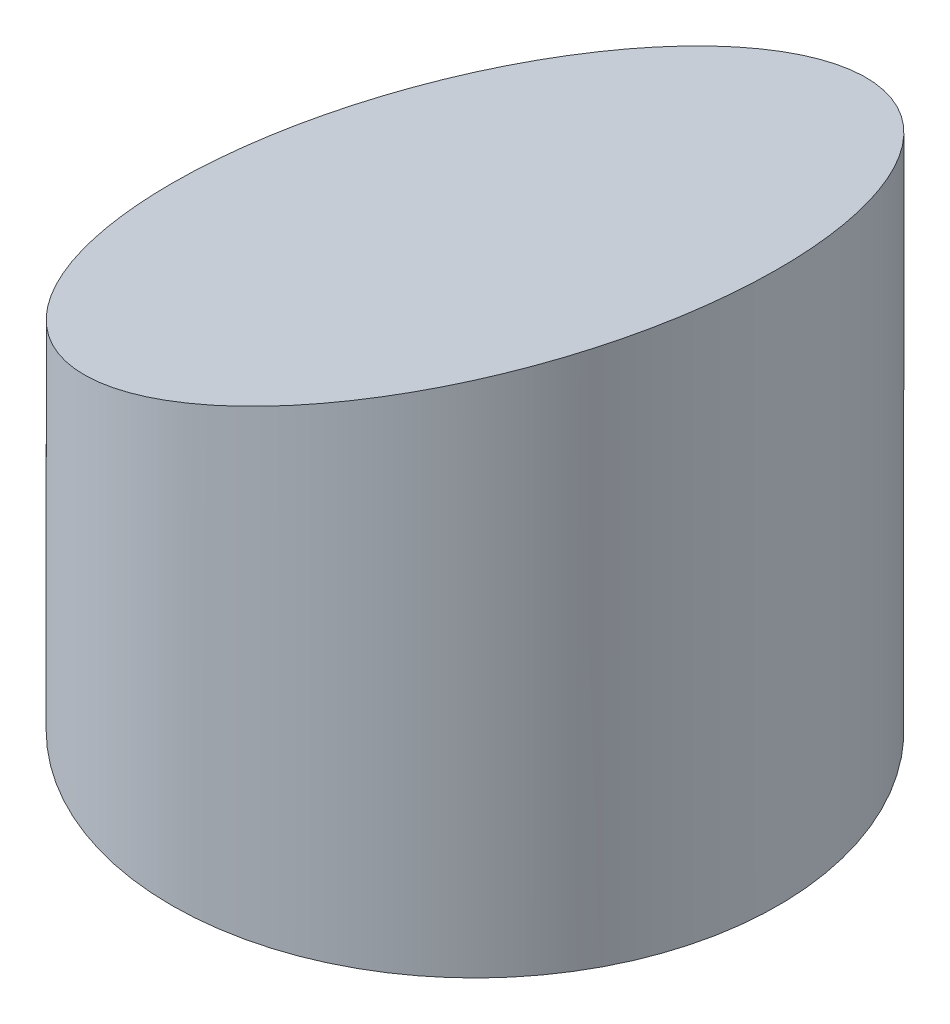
ISO-10303-21;
HEADER;
FILE_DESCRIPTION(('STEP AP214'),'2;1');
FILE_NAME('part.step','',(''),(''),'','','');
FILE_SCHEMA(('AUTOMOTIVE_DESIGN { 1 0 10303 214 1 1 1 1 }'));
ENDSEC;
DATA;
#1=APPLICATION_CONTEXT('core data for automotive mechanical design processes');
#2=APPLICATION_PROTOCOL_DEFINITION('international standard','automotive_design',2000,#1);
#3=PRODUCT_CONTEXT('',#1,'mechanical');
#4=PRODUCT('Part','Part','',(#3));
#5=PRODUCT_RELATED_PRODUCT_CATEGORY('part','',(#4));
#6=PRODUCT_DEFINITION_FORMATION('','',#4);
#7=PRODUCT_DEFINITION_CONTEXT('part definition',#1,'design');
#8=PRODUCT_DEFINITION('design','',#6,#7);
#9=PRODUCT_DEFINITION_SHAPE('','',#8);
#10=(LENGTH_UNIT() NAMED_UNIT(*) SI_UNIT(.MILLI.,.METRE.));
#11=(NAMED_UNIT(*) PLANE_ANGLE_UNIT() SI_UNIT($,.RADIAN.));
#12=(NAMED_UNIT(*) SI_UNIT($,.STERADIAN.) SOLID_ANGLE_UNIT());
#13=UNCERTAINTY_MEASURE_WITH_UNIT(LENGTH_MEASURE(1.E-05),#10,'distance_accuracy_value','');
#14=(GEOMETRIC_REPRESENTATION_CONTEXT(3) GLOBAL_UNCERTAINTY_ASSIGNED_CONTEXT((#13)) GLOBAL_UNIT_ASSIGNED_CONTEXT((#10,
#11,#12)) REPRESENTATION_CONTEXT('',''));
#15=CARTESIAN_POINT('',(0.,0.,0.));
#16=DIRECTION('',(0.,0.,1.));
#17=DIRECTION('',(1.,0.,0.));
#18=AXIS2_PLACEMENT_3D('',#15,#16,#17);
#19=CARTESIAN_POINT('',(-20.3749981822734,53.9025138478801,2.01196150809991E-13));
#20=DIRECTION('',(0.35358015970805,-0.935404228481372,0.));
#21=DIRECTION('',(0.935404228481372,0.35358015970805,0.));
#22=AXIS2_PLACEMENT_3D('',#19,#20,#21);
#23=PLANE('',#22);
#24=CARTESIAN_POINT('',(0.,61.6042056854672,0.));
#25=DIRECTION('',(0.35358015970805,-0.935404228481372,0.));
#26=DIRECTION('',(-0.935404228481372,-0.35358015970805,0.));
#27=AXIS2_PLACEMENT_3D('',#24,#25,#26);
#28=ELLIPSE('',#27,45.7309322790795,42.7769074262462);
#29=CARTESIAN_POINT('',(-42.7769074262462,45.4346553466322,4.22407356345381E-13));
#30=VERTEX_POINT('',#29);
#31=EDGE_CURVE('E30',#30,#30,#28,.T.);
#32=ORIENTED_EDGE('',*,*,#31,.F.);
#33=EDGE_LOOP('',(#32));
#34=FACE_BOUND('',#33,.T.);
#35=ADVANCED_FACE('F26',(#34),#23,.F.);
#36=CARTESIAN_POINT('',(0.,100.,0.));
#37=DIRECTION('',(0.,-1.,0.));
#38=DIRECTION('',(0.,0.,-1.));
#39=AXIS2_PLACEMENT_3D('',#36,#37,#38);
#40=CYLINDRICAL_SURFACE('',#39,42.7769074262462);
#41=ORIENTED_EDGE('',*,*,#31,.T.);
#42=EDGE_LOOP('',(#41));
#43=FACE_BOUND('',#42,.T.);
#44=CARTESIAN_POINT('',(0.,0.,0.));
#45=DIRECTION('',(0.,1.,0.));
#46=DIRECTION('',(0.,0.,1.));
#47=AXIS2_PLACEMENT_3D('',#44,#45,#46);
#48=CIRCLE('',#47,42.7769074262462);
#49=CARTESIAN_POINT('',(0.,0.,42.7769074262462));
#50=VERTEX_POINT('',#49);
#51=EDGE_CURVE('E11',#50,#50,#48,.T.);
#52=ORIENTED_EDGE('',*,*,#51,.T.);
#53=EDGE_LOOP('',(#52));
#54=FACE_BOUND('',#53,.T.);
#55=ADVANCED_FACE('F28',(#43,#54),#40,.T.);
#56=CARTESIAN_POINT('',(0.,0.,0.));
#57=DIRECTION('',(0.,1.,0.));
#58=DIRECTION('',(0.,0.,1.));
#59=AXIS2_PLACEMENT_3D('',#56,#57,#58);
#60=PLANE('',#59);
#61=ORIENTED_EDGE('',*,*,#51,.F.);
#62=EDGE_LOOP('',(#61));
#63=FACE_BOUND('',#62,.T.);
#64=ADVANCED_FACE('F46',(#63),#60,.F.);
#65=CLOSED_SHELL('',(#35,#55,#64));
#66=MANIFOLD_SOLID_BREP('B2',#65);
#67=ADVANCED_BREP_SHAPE_REPRESENTATION('',(#18,#66),#14);
#68=SHAPE_DEFINITION_REPRESENTATION(#9,#67);
ENDSEC;
END-ISO-10303-21;
